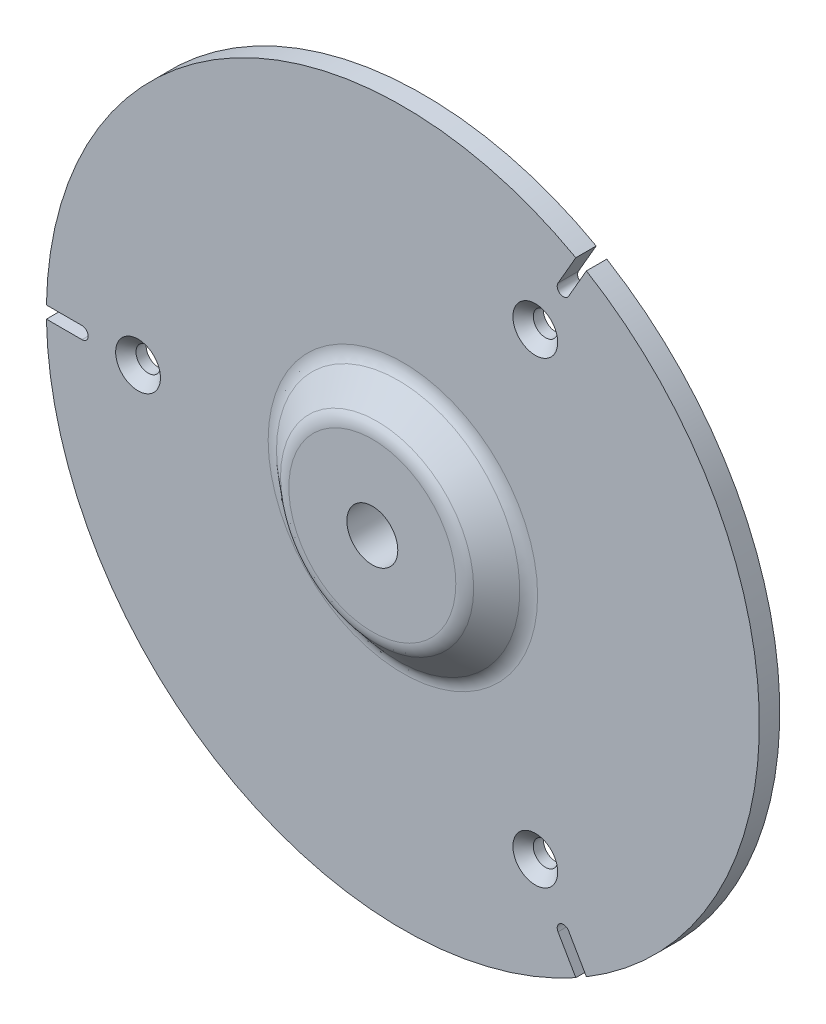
ISO-10303-21;
HEADER;
FILE_DESCRIPTION(('STEP AP214'),'2;1');
FILE_NAME('part.step','',(''),(''),'','','');
FILE_SCHEMA(('AUTOMOTIVE_DESIGN { 1 0 10303 214 1 1 1 1 }'));
ENDSEC;
DATA;
#1=APPLICATION_CONTEXT('core data for automotive mechanical design processes');
#2=APPLICATION_PROTOCOL_DEFINITION('international standard','automotive_design',2000,#1);
#3=PRODUCT_CONTEXT('',#1,'mechanical');
#4=PRODUCT('Part','Part','',(#3));
#5=PRODUCT_RELATED_PRODUCT_CATEGORY('part','',(#4));
#6=PRODUCT_DEFINITION_FORMATION('','',#4);
#7=PRODUCT_DEFINITION_CONTEXT('part definition',#1,'design');
#8=PRODUCT_DEFINITION('design','',#6,#7);
#9=PRODUCT_DEFINITION_SHAPE('','',#8);
#10=(LENGTH_UNIT() NAMED_UNIT(*) SI_UNIT(.MILLI.,.METRE.));
#11=(NAMED_UNIT(*) PLANE_ANGLE_UNIT() SI_UNIT($,.RADIAN.));
#12=(NAMED_UNIT(*) SI_UNIT($,.STERADIAN.) SOLID_ANGLE_UNIT());
#13=UNCERTAINTY_MEASURE_WITH_UNIT(LENGTH_MEASURE(1.E-05),#10,'distance_accuracy_value','');
#14=(GEOMETRIC_REPRESENTATION_CONTEXT(3) GLOBAL_UNCERTAINTY_ASSIGNED_CONTEXT((#13)) GLOBAL_UNIT_ASSIGNED_CONTEXT((#10,
#11,#12)) REPRESENTATION_CONTEXT('',''));
#15=CARTESIAN_POINT('',(0.,0.,0.));
#16=DIRECTION('',(0.,0.,1.));
#17=DIRECTION('',(1.,0.,0.));
#18=AXIS2_PLACEMENT_3D('',#15,#16,#17);
#19=CARTESIAN_POINT('',(0.,0.,2.));
#20=DIRECTION('',(0.,0.,-1.));
#21=DIRECTION('',(-1.,0.,0.));
#22=AXIS2_PLACEMENT_3D('',#19,#20,#21);
#23=PLANE('',#22);
#24=CARTESIAN_POINT('',(13.0000000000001,-22.5166604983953,2.));
#25=DIRECTION('',(0.,0.,1.));
#26=DIRECTION('',(1.,0.,0.));
#27=AXIS2_PLACEMENT_3D('',#24,#25,#26);
#28=CIRCLE('',#27,2.2);
#29=CARTESIAN_POINT('',(15.2000000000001,-22.5166604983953,2.));
#30=VERTEX_POINT('',#29);
#31=EDGE_CURVE('E246',#30,#30,#28,.T.);
#32=ORIENTED_EDGE('',*,*,#31,.F.);
#33=EDGE_LOOP('',(#32));
#34=FACE_BOUND('',#33,.T.);
#35=CARTESIAN_POINT('',(-26.,0.,2.));
#36=DIRECTION('',(0.,0.,1.));
#37=DIRECTION('',(1.,0.,0.));
#38=AXIS2_PLACEMENT_3D('',#35,#36,#37);
#39=CIRCLE('',#38,2.2);
#40=CARTESIAN_POINT('',(-23.8,0.,2.));
#41=VERTEX_POINT('',#40);
#42=EDGE_CURVE('E200',#41,#41,#39,.T.);
#43=ORIENTED_EDGE('',*,*,#42,.F.);
#44=EDGE_LOOP('',(#43));
#45=FACE_BOUND('',#44,.T.);
#46=CARTESIAN_POINT('',(0.,0.,2.));
#47=DIRECTION('',(0.,0.,-1.));
#48=DIRECTION('',(-1.,0.,0.));
#49=AXIS2_PLACEMENT_3D('',#46,#47,#48);
#50=CIRCLE('',#49,13.2279404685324);
#51=CARTESIAN_POINT('',(-13.2279404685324,0.,2.));
#52=VERTEX_POINT('',#51);
#53=EDGE_CURVE('E11',#52,#52,#50,.T.);
#54=ORIENTED_EDGE('',*,*,#53,.T.);
#55=EDGE_LOOP('',(#54));
#56=FACE_BOUND('',#55,.T.);
#57=CARTESIAN_POINT('',(0.,0.,2.));
#58=DIRECTION('',(0.,0.,-1.));
#59=DIRECTION('',(-1.,0.,0.));
#60=AXIS2_PLACEMENT_3D('',#57,#58,#59);
#61=CIRCLE('',#60,35.);
#62=CARTESIAN_POINT('',(18.0170436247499,30.0064349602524,2.));
#63=VERTEX_POINT('',#62);
#64=CARTESIAN_POINT('',(18.0170436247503,-30.0064349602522,2.));
#65=VERTEX_POINT('',#64);
#66=EDGE_CURVE('E148',#63,#65,#61,.T.);
#67=ORIENTED_EDGE('',*,*,#66,.F.);
#68=DIRECTION('',(0.499999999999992,0.866025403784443,0.));
#69=VECTOR('',#68,1.);
#70=CARTESIAN_POINT('',(18.0170436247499,30.0064349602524,2.));
#71=LINE('',#70,#69);
#72=CARTESIAN_POINT('',(16.2696152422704,26.97980021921,2.));
#73=VERTEX_POINT('',#72);
#74=EDGE_CURVE('E131',#73,#63,#71,.T.);
#75=ORIENTED_EDGE('',*,*,#74,.F.);
#76=CARTESIAN_POINT('',(15.7499999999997,27.27980021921,2.));
#77=DIRECTION('',(0.,0.,1.));
#78=DIRECTION('',(0.499999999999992,0.866025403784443,0.));
#79=AXIS2_PLACEMENT_3D('',#76,#77,#78);
#80=CIRCLE('',#79,0.600000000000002);
#81=CARTESIAN_POINT('',(15.2303847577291,27.57980021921,2.));
#82=VERTEX_POINT('',#81);
#83=EDGE_CURVE('E141',#82,#73,#80,.T.);
#84=ORIENTED_EDGE('',*,*,#83,.F.);
#85=DIRECTION('',(-0.499999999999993,-0.866025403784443,0.));
#86=VECTOR('',#85,1.);
#87=CARTESIAN_POINT('',(16.9778131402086,30.6064349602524,2.));
#88=LINE('',#87,#86);
#89=CARTESIAN_POINT('',(16.9778131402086,30.6064349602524,2.));
#90=VERTEX_POINT('',#89);
#91=EDGE_CURVE('E125',#90,#82,#88,.T.);
#92=ORIENTED_EDGE('',*,*,#91,.F.);
#93=CARTESIAN_POINT('',(-34.994856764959,0.6,2.));
#94=VERTEX_POINT('',#93);
#95=EDGE_CURVE('E138',#94,#90,#61,.T.);
#96=ORIENTED_EDGE('',*,*,#95,.F.);
#97=DIRECTION('',(-1.,0.,0.));
#98=VECTOR('',#97,1.);
#99=CARTESIAN_POINT('',(-34.994856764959,0.6,2.));
#100=LINE('',#99,#98);
#101=CARTESIAN_POINT('',(-31.5,0.6,2.));
#102=VERTEX_POINT('',#101);
#103=EDGE_CURVE('E182',#102,#94,#100,.T.);
#104=ORIENTED_EDGE('',*,*,#103,.F.);
#105=CARTESIAN_POINT('',(-31.5,0.,2.));
#106=DIRECTION('',(0.,0.,1.));
#107=DIRECTION('',(-1.,0.,0.));
#108=AXIS2_PLACEMENT_3D('',#105,#106,#107);
#109=CIRCLE('',#108,0.600000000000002);
#110=CARTESIAN_POINT('',(-31.5,-0.600000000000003,2.));
#111=VERTEX_POINT('',#110);
#112=EDGE_CURVE('E188',#111,#102,#109,.T.);
#113=ORIENTED_EDGE('',*,*,#112,.F.);
#114=DIRECTION('',(1.,0.,0.));
#115=VECTOR('',#114,1.);
#116=CARTESIAN_POINT('',(-34.994856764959,-0.6,2.));
#117=LINE('',#116,#115);
#118=CARTESIAN_POINT('',(-34.994856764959,-0.6,2.));
#119=VERTEX_POINT('',#118);
#120=EDGE_CURVE('E191',#119,#111,#117,.T.);
#121=ORIENTED_EDGE('',*,*,#120,.F.);
#122=CARTESIAN_POINT('',(16.977813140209,-30.6064349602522,2.));
#123=VERTEX_POINT('',#122);
#124=EDGE_CURVE('E150',#123,#119,#61,.T.);
#125=ORIENTED_EDGE('',*,*,#124,.F.);
#126=DIRECTION('',(0.500000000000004,-0.866025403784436,0.));
#127=VECTOR('',#126,1.);
#128=CARTESIAN_POINT('',(16.977813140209,-30.6064349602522,2.));
#129=LINE('',#128,#127);
#130=CARTESIAN_POINT('',(15.2303847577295,-27.5798002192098,2.));
#131=VERTEX_POINT('',#130);
#132=EDGE_CURVE('E214',#131,#123,#129,.T.);
#133=ORIENTED_EDGE('',*,*,#132,.F.);
#134=CARTESIAN_POINT('',(15.7500000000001,-27.2798002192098,2.));
#135=DIRECTION('',(0.,0.,1.));
#136=DIRECTION('',(0.500000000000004,-0.866025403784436,0.));
#137=AXIS2_PLACEMENT_3D('',#134,#135,#136);
#138=CIRCLE('',#137,0.600000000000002);
#139=CARTESIAN_POINT('',(16.2696152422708,-26.9798002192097,2.));
#140=VERTEX_POINT('',#139);
#141=EDGE_CURVE('E220',#140,#131,#138,.T.);
#142=ORIENTED_EDGE('',*,*,#141,.F.);
#143=DIRECTION('',(-0.500000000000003,0.866025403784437,0.));
#144=VECTOR('',#143,1.);
#145=CARTESIAN_POINT('',(18.0170436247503,-30.0064349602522,2.));
#146=LINE('',#145,#144);
#147=EDGE_CURVE('E223',#65,#140,#146,.T.);
#148=ORIENTED_EDGE('',*,*,#147,.F.);
#149=EDGE_LOOP('',(#67,#75,#84,#92,#96,#104,#113,#121,#125,#133,#142,#148));
#150=FACE_BOUND('',#149,.T.);
#151=CARTESIAN_POINT('',(12.9999999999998,22.5166604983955,2.));
#152=DIRECTION('',(0.,0.,1.));
#153=DIRECTION('',(1.,0.,0.));
#154=AXIS2_PLACEMENT_3D('',#151,#152,#153);
#155=CIRCLE('',#154,2.2);
#156=CARTESIAN_POINT('',(15.1999999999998,22.5166604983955,2.));
#157=VERTEX_POINT('',#156);
#158=EDGE_CURVE('E255',#157,#157,#155,.T.);
#159=ORIENTED_EDGE('',*,*,#158,.F.);
#160=EDGE_LOOP('',(#159));
#161=FACE_BOUND('',#160,.T.);
#162=ADVANCED_FACE('F33',(#34,#45,#56,#150,#161),#23,.F.);
#163=CARTESIAN_POINT('',(0.,0.,100.994949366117));
#164=DIRECTION('',(0.,0.,-1.));
#165=DIRECTION('',(-1.,0.,0.));
#166=AXIS2_PLACEMENT_3D('',#163,#164,#165);
#167=CYLINDRICAL_SURFACE('',#166,35.);
#168=CARTESIAN_POINT('',(0.,0.,0.));
#169=DIRECTION('',(0.,0.,1.));
#170=DIRECTION('',(1.,0.,0.));
#171=AXIS2_PLACEMENT_3D('',#168,#169,#170);
#172=CIRCLE('',#171,35.);
#173=CARTESIAN_POINT('',(18.0170436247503,-30.0064349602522,0.));
#174=VERTEX_POINT('',#173);
#175=CARTESIAN_POINT('',(18.0170436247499,30.0064349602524,0.));
#176=VERTEX_POINT('',#175);
#177=EDGE_CURVE('E164',#174,#176,#172,.T.);
#178=ORIENTED_EDGE('',*,*,#177,.T.);
#179=DIRECTION('',(0.,0.,1.));
#180=VECTOR('',#179,1.);
#181=CARTESIAN_POINT('',(18.0170436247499,30.0064349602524,-0.00100000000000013));
#182=LINE('',#181,#180);
#183=EDGE_CURVE('E232',#176,#63,#182,.T.);
#184=ORIENTED_EDGE('',*,*,#183,.T.);
#185=ORIENTED_EDGE('',*,*,#66,.T.);
#186=DIRECTION('',(0.,0.,1.));
#187=VECTOR('',#186,1.);
#188=CARTESIAN_POINT('',(18.0170436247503,-30.0064349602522,-0.00100000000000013));
#189=LINE('',#188,#187);
#190=EDGE_CURVE('E211',#174,#65,#189,.T.);
#191=ORIENTED_EDGE('',*,*,#190,.F.);
#192=EDGE_LOOP('',(#178,#184,#185,#191));
#193=FACE_BOUND('',#192,.T.);
#194=ADVANCED_FACE('F281',(#193),#167,.T.);
#195=CARTESIAN_POINT('',(-34.9948567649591,-0.6,0.));
#196=VERTEX_POINT('',#195);
#197=CARTESIAN_POINT('',(16.977813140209,-30.6064349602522,0.));
#198=VERTEX_POINT('',#197);
#199=EDGE_CURVE('E157',#196,#198,#172,.T.);
#200=ORIENTED_EDGE('',*,*,#199,.T.);
#201=DIRECTION('',(0.,0.,1.));
#202=VECTOR('',#201,1.);
#203=CARTESIAN_POINT('',(16.977813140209,-30.6064349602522,-0.00100000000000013));
#204=LINE('',#203,#202);
#205=EDGE_CURVE('E210',#198,#123,#204,.T.);
#206=ORIENTED_EDGE('',*,*,#205,.T.);
#207=ORIENTED_EDGE('',*,*,#124,.T.);
#208=DIRECTION('',(0.,0.,1.));
#209=VECTOR('',#208,1.);
#210=CARTESIAN_POINT('',(-34.994856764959,-0.6,-0.00100000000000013));
#211=LINE('',#210,#209);
#212=EDGE_CURVE('E179',#196,#119,#211,.T.);
#213=ORIENTED_EDGE('',*,*,#212,.F.);
#214=EDGE_LOOP('',(#200,#206,#207,#213));
#215=FACE_BOUND('',#214,.T.);
#216=ADVANCED_FACE('F287',(#215),#167,.T.);
#217=CARTESIAN_POINT('',(0.,0.,0.));
#218=DIRECTION('',(0.,0.,1.));
#219=DIRECTION('',(1.,0.,0.));
#220=AXIS2_PLACEMENT_3D('',#217,#218,#219);
#221=PLANE('',#220);
#222=CARTESIAN_POINT('',(12.9999999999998,22.5166604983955,0.));
#223=DIRECTION('',(0.,0.,1.));
#224=DIRECTION('',(1.,0.,0.));
#225=AXIS2_PLACEMENT_3D('',#222,#223,#224);
#226=CIRCLE('',#225,1.2);
#227=CARTESIAN_POINT('',(14.1999999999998,22.5166604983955,0.));
#228=VERTEX_POINT('',#227);
#229=EDGE_CURVE('E261',#228,#228,#226,.T.);
#230=ORIENTED_EDGE('',*,*,#229,.T.);
#231=EDGE_LOOP('',(#230));
#232=FACE_BOUND('',#231,.T.);
#233=CARTESIAN_POINT('',(13.0000000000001,-22.5166604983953,0.));
#234=DIRECTION('',(0.,0.,1.));
#235=DIRECTION('',(1.,0.,0.));
#236=AXIS2_PLACEMENT_3D('',#233,#234,#235);
#237=CIRCLE('',#236,1.2);
#238=CARTESIAN_POINT('',(14.2000000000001,-22.5166604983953,0.));
#239=VERTEX_POINT('',#238);
#240=EDGE_CURVE('E252',#239,#239,#237,.T.);
#241=ORIENTED_EDGE('',*,*,#240,.T.);
#242=EDGE_LOOP('',(#241));
#243=FACE_BOUND('',#242,.T.);
#244=CARTESIAN_POINT('',(-26.,0.,0.));
#245=DIRECTION('',(0.,0.,1.));
#246=DIRECTION('',(1.,0.,0.));
#247=AXIS2_PLACEMENT_3D('',#244,#245,#246);
#248=CIRCLE('',#247,1.2);
#249=CARTESIAN_POINT('',(-24.8,0.,0.));
#250=VERTEX_POINT('',#249);
#251=EDGE_CURVE('E206',#250,#250,#248,.T.);
#252=ORIENTED_EDGE('',*,*,#251,.T.);
#253=EDGE_LOOP('',(#252));
#254=FACE_BOUND('',#253,.T.);
#255=CARTESIAN_POINT('',(0.,0.,0.));
#256=DIRECTION('',(0.,0.,1.));
#257=DIRECTION('',(1.,0.,0.));
#258=AXIS2_PLACEMENT_3D('',#255,#256,#257);
#259=CIRCLE('',#258,2.5);
#260=CARTESIAN_POINT('',(2.5,0.,0.));
#261=VERTEX_POINT('',#260);
#262=EDGE_CURVE('E169',#261,#261,#259,.T.);
#263=ORIENTED_EDGE('',*,*,#262,.T.);
#264=EDGE_LOOP('',(#263));
#265=FACE_BOUND('',#264,.T.);
#266=CARTESIAN_POINT('',(15.7499999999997,27.27980021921,0.));
#267=DIRECTION('',(0.,0.,1.));
#268=DIRECTION('',(1.,0.,0.));
#269=AXIS2_PLACEMENT_3D('',#266,#267,#268);
#270=CIRCLE('',#269,0.600000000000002);
#271=CARTESIAN_POINT('',(16.2696152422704,26.97980021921,0.));
#272=VERTEX_POINT('',#271);
#273=CARTESIAN_POINT('',(15.2303847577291,27.57980021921,0.));
#274=VERTEX_POINT('',#273);
#275=EDGE_CURVE('E243',#272,#274,#270,.F.);
#276=ORIENTED_EDGE('',*,*,#275,.F.);
#277=DIRECTION('',(-0.499999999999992,-0.866025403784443,0.));
#278=VECTOR('',#277,1.);
#279=CARTESIAN_POINT('',(18.0170436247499,30.0064349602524,0.));
#280=LINE('',#279,#278);
#281=EDGE_CURVE('E142',#176,#272,#280,.T.);
#282=ORIENTED_EDGE('',*,*,#281,.F.);
#283=ORIENTED_EDGE('',*,*,#177,.F.);
#284=DIRECTION('',(0.500000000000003,-0.866025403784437,0.));
#285=VECTOR('',#284,1.);
#286=CARTESIAN_POINT('',(18.0170436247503,-30.0064349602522,0.));
#287=LINE('',#286,#285);
#288=CARTESIAN_POINT('',(16.2696152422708,-26.9798002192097,0.));
#289=VERTEX_POINT('',#288);
#290=EDGE_CURVE('E57',#289,#174,#287,.T.);
#291=ORIENTED_EDGE('',*,*,#290,.F.);
#292=CARTESIAN_POINT('',(15.7500000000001,-27.2798002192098,0.));
#293=DIRECTION('',(0.,0.,1.));
#294=DIRECTION('',(1.,0.,0.));
#295=AXIS2_PLACEMENT_3D('',#292,#293,#294);
#296=CIRCLE('',#295,0.600000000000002);
#297=CARTESIAN_POINT('',(15.2303847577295,-27.5798002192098,0.));
#298=VERTEX_POINT('',#297);
#299=EDGE_CURVE('E229',#298,#289,#296,.F.);
#300=ORIENTED_EDGE('',*,*,#299,.F.);
#301=DIRECTION('',(-0.500000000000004,0.866025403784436,0.));
#302=VECTOR('',#301,1.);
#303=CARTESIAN_POINT('',(16.977813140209,-30.6064349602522,0.));
#304=LINE('',#303,#302);
#305=EDGE_CURVE('E226',#198,#298,#304,.T.);
#306=ORIENTED_EDGE('',*,*,#305,.F.);
#307=ORIENTED_EDGE('',*,*,#199,.F.);
#308=DIRECTION('',(-1.,0.,0.));
#309=VECTOR('',#308,1.);
#310=CARTESIAN_POINT('',(-34.994856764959,-0.6,0.));
#311=LINE('',#310,#309);
#312=CARTESIAN_POINT('',(-31.5,-0.600000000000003,0.));
#313=VERTEX_POINT('',#312);
#314=EDGE_CURVE('E175',#313,#196,#311,.T.);
#315=ORIENTED_EDGE('',*,*,#314,.F.);
#316=CARTESIAN_POINT('',(-31.5,0.,0.));
#317=DIRECTION('',(0.,0.,1.));
#318=DIRECTION('',(1.,0.,0.));
#319=AXIS2_PLACEMENT_3D('',#316,#317,#318);
#320=CIRCLE('',#319,0.600000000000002);
#321=CARTESIAN_POINT('',(-31.5,0.6,0.));
#322=VERTEX_POINT('',#321);
#323=EDGE_CURVE('E197',#322,#313,#320,.F.);
#324=ORIENTED_EDGE('',*,*,#323,.F.);
#325=DIRECTION('',(1.,0.,0.));
#326=VECTOR('',#325,1.);
#327=CARTESIAN_POINT('',(-34.994856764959,0.6,0.));
#328=LINE('',#327,#326);
#329=CARTESIAN_POINT('',(-34.994856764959,0.6,0.));
#330=VERTEX_POINT('',#329);
#331=EDGE_CURVE('E194',#330,#322,#328,.T.);
#332=ORIENTED_EDGE('',*,*,#331,.F.);
#333=CARTESIAN_POINT('',(16.9778131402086,30.6064349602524,0.));
#334=VERTEX_POINT('',#333);
#335=EDGE_CURVE('E165',#334,#330,#172,.T.);
#336=ORIENTED_EDGE('',*,*,#335,.F.);
#337=DIRECTION('',(0.499999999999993,0.866025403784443,0.));
#338=VECTOR('',#337,1.);
#339=CARTESIAN_POINT('',(16.9778131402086,30.6064349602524,0.));
#340=LINE('',#339,#338);
#341=EDGE_CURVE('E49',#274,#334,#340,.T.);
#342=ORIENTED_EDGE('',*,*,#341,.F.);
#343=EDGE_LOOP('',(#276,#282,#283,#291,#300,#306,#307,#315,#324,#332,#336,#342));
#344=FACE_BOUND('',#343,.T.);
#345=ADVANCED_FACE('F265',(#232,#243,#254,#265,#344),#221,.F.);
#346=ORIENTED_EDGE('',*,*,#95,.T.);
#347=DIRECTION('',(0.,0.,1.));
#348=VECTOR('',#347,1.);
#349=CARTESIAN_POINT('',(16.9778131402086,30.6064349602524,-0.00100000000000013));
#350=LINE('',#349,#348);
#351=EDGE_CURVE('E122',#334,#90,#350,.T.);
#352=ORIENTED_EDGE('',*,*,#351,.F.);
#353=ORIENTED_EDGE('',*,*,#335,.T.);
#354=DIRECTION('',(0.,0.,1.));
#355=VECTOR('',#354,1.);
#356=CARTESIAN_POINT('',(-34.994856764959,0.6,-0.00100000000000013));
#357=LINE('',#356,#355);
#358=EDGE_CURVE('E146',#330,#94,#357,.T.);
#359=ORIENTED_EDGE('',*,*,#358,.T.);
#360=EDGE_LOOP('',(#346,#352,#353,#359));
#361=FACE_BOUND('',#360,.T.);
#362=ADVANCED_FACE('F35',(#361),#167,.T.);
#363=CARTESIAN_POINT('',(0.,0.,2.));
#364=DIRECTION('',(0.,0.,-1.));
#365=DIRECTION('',(1.,0.,0.));
#366=AXIS2_PLACEMENT_3D('',#363,#364,#365);
#367=CONICAL_SURFACE('',#366,12.5,0.872664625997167);
#368=CARTESIAN_POINT('',(0.,0.,4.53208888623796));
#369=DIRECTION('',(0.,0.,-1.));
#370=DIRECTION('',(-1.,0.,0.));
#371=AXIS2_PLACEMENT_3D('',#368,#369,#370);
#372=CIRCLE('',#371,9.48237397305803);
#373=CARTESIAN_POINT('',(-9.48237397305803,0.,4.53208888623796));
#374=VERTEX_POINT('',#373);
#375=EDGE_CURVE('E42',#374,#374,#372,.T.);
#376=ORIENTED_EDGE('',*,*,#375,.T.);
#377=EDGE_LOOP('',(#376));
#378=FACE_BOUND('',#377,.T.);
#379=CARTESIAN_POINT('',(0.,0.,2.46791111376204));
#380=DIRECTION('',(0.,0.,-1.));
#381=DIRECTION('',(-1.,0.,0.));
#382=AXIS2_PLACEMENT_3D('',#379,#380,#381);
#383=CIRCLE('',#382,11.9423652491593);
#384=CARTESIAN_POINT('',(-11.9423652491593,0.,2.46791111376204));
#385=VERTEX_POINT('',#384);
#386=EDGE_CURVE('E153',#385,#385,#383,.F.);
#387=ORIENTED_EDGE('',*,*,#386,.T.);
#388=EDGE_LOOP('',(#387));
#389=FACE_BOUND('',#388,.T.);
#390=ADVANCED_FACE('F292',(#378,#389),#367,.T.);
#391=CARTESIAN_POINT('',(0.,0.,5.));
#392=DIRECTION('',(0.,0.,1.));
#393=DIRECTION('',(1.,0.,0.));
#394=AXIS2_PLACEMENT_3D('',#391,#392,#393);
#395=PLANE('',#394);
#396=CARTESIAN_POINT('',(0.,0.,5.));
#397=DIRECTION('',(0.,0.,1.));
#398=DIRECTION('',(1.,0.,0.));
#399=AXIS2_PLACEMENT_3D('',#396,#397,#398);
#400=CIRCLE('',#399,2.49999999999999);
#401=CARTESIAN_POINT('',(2.49999999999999,0.,5.));
#402=VERTEX_POINT('',#401);
#403=EDGE_CURVE('E171',#402,#402,#400,.T.);
#404=ORIENTED_EDGE('',*,*,#403,.F.);
#405=EDGE_LOOP('',(#404));
#406=FACE_BOUND('',#405,.T.);
#407=CARTESIAN_POINT('',(0.,0.,5.));
#408=DIRECTION('',(0.,0.,1.));
#409=DIRECTION('',(1.,0.,0.));
#410=AXIS2_PLACEMENT_3D('',#407,#408,#409);
#411=CIRCLE('',#410,8.19679875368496);
#412=CARTESIAN_POINT('',(8.19679875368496,0.,5.));
#413=VERTEX_POINT('',#412);
#414=EDGE_CURVE('E147',#413,#413,#411,.T.);
#415=ORIENTED_EDGE('',*,*,#414,.T.);
#416=EDGE_LOOP('',(#415));
#417=FACE_BOUND('',#416,.T.);
#418=ADVANCED_FACE('F389',(#406,#417),#395,.T.);
#419=CARTESIAN_POINT('',(0.,0.,3.));
#420=DIRECTION('',(0.,0.,1.));
#421=DIRECTION('',(1.,0.,0.));
#422=AXIS2_PLACEMENT_3D('',#419,#420,#421);
#423=TOROIDAL_SURFACE('',#422,8.19679875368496,2.);
#424=ORIENTED_EDGE('',*,*,#375,.F.);
#425=EDGE_LOOP('',(#424));
#426=FACE_BOUND('',#425,.T.);
#427=ORIENTED_EDGE('',*,*,#414,.F.);
#428=EDGE_LOOP('',(#427));
#429=FACE_BOUND('',#428,.T.);
#430=ADVANCED_FACE('F394',(#426,#429),#423,.T.);
#431=CARTESIAN_POINT('',(0.,0.,4.));
#432=DIRECTION('',(0.,0.,-1.));
#433=DIRECTION('',(-1.,0.,0.));
#434=AXIS2_PLACEMENT_3D('',#431,#432,#433);
#435=TOROIDAL_SURFACE('',#434,13.2279404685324,2.);
#436=ORIENTED_EDGE('',*,*,#53,.F.);
#437=EDGE_LOOP('',(#436));
#438=FACE_BOUND('',#437,.T.);
#439=ORIENTED_EDGE('',*,*,#386,.F.);
#440=EDGE_LOOP('',(#439));
#441=FACE_BOUND('',#440,.T.);
#442=ADVANCED_FACE('F381',(#438,#441),#435,.F.);
#443=CARTESIAN_POINT('',(0.,0.,5.));
#444=DIRECTION('',(0.,0.,1.));
#445=DIRECTION('',(1.,0.,0.));
#446=AXIS2_PLACEMENT_3D('',#443,#444,#445);
#447=CYLINDRICAL_SURFACE('',#446,2.49999999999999);
#448=ORIENTED_EDGE('',*,*,#262,.F.);
#449=EDGE_LOOP('',(#448));
#450=FACE_BOUND('',#449,.T.);
#451=ORIENTED_EDGE('',*,*,#403,.T.);
#452=EDGE_LOOP('',(#451));
#453=FACE_BOUND('',#452,.T.);
#454=ADVANCED_FACE('F370',(#450,#453),#447,.F.);
#455=CARTESIAN_POINT('',(-34.994856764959,0.6,-0.00100000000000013));
#456=DIRECTION('',(0.,1.,0.));
#457=DIRECTION('',(-1.,0.,0.));
#458=AXIS2_PLACEMENT_3D('',#455,#456,#457);
#459=PLANE('',#458);
#460=ORIENTED_EDGE('',*,*,#331,.T.);
#461=DIRECTION('',(0.,0.,1.));
#462=VECTOR('',#461,1.);
#463=CARTESIAN_POINT('',(-31.5,0.6,-0.00100000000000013));
#464=LINE('',#463,#462);
#465=EDGE_CURVE('E184',#322,#102,#464,.T.);
#466=ORIENTED_EDGE('',*,*,#465,.T.);
#467=ORIENTED_EDGE('',*,*,#103,.T.);
#468=ORIENTED_EDGE('',*,*,#358,.F.);
#469=EDGE_LOOP('',(#460,#466,#467,#468));
#470=FACE_BOUND('',#469,.T.);
#471=ADVANCED_FACE('F360',(#470),#459,.F.);
#472=CARTESIAN_POINT('',(-31.5,0.,-0.00100000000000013));
#473=DIRECTION('',(0.,0.,1.));
#474=DIRECTION('',(1.,0.,0.));
#475=AXIS2_PLACEMENT_3D('',#472,#473,#474);
#476=CYLINDRICAL_SURFACE('',#475,0.600000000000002);
#477=ORIENTED_EDGE('',*,*,#323,.T.);
#478=DIRECTION('',(0.,0.,1.));
#479=VECTOR('',#478,1.);
#480=CARTESIAN_POINT('',(-31.5,-0.600000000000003,-0.00100000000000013));
#481=LINE('',#480,#479);
#482=EDGE_CURVE('E181',#313,#111,#481,.T.);
#483=ORIENTED_EDGE('',*,*,#482,.T.);
#484=ORIENTED_EDGE('',*,*,#112,.T.);
#485=ORIENTED_EDGE('',*,*,#465,.F.);
#486=EDGE_LOOP('',(#477,#483,#484,#485));
#487=FACE_BOUND('',#486,.T.);
#488=ADVANCED_FACE('F350',(#487),#476,.F.);
#489=CARTESIAN_POINT('',(-34.994856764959,-0.6,-0.00100000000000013));
#490=DIRECTION('',(0.,-1.,0.));
#491=DIRECTION('',(1.,0.,0.));
#492=AXIS2_PLACEMENT_3D('',#489,#490,#491);
#493=PLANE('',#492);
#494=ORIENTED_EDGE('',*,*,#314,.T.);
#495=ORIENTED_EDGE('',*,*,#212,.T.);
#496=ORIENTED_EDGE('',*,*,#120,.T.);
#497=ORIENTED_EDGE('',*,*,#482,.F.);
#498=EDGE_LOOP('',(#494,#495,#496,#497));
#499=FACE_BOUND('',#498,.T.);
#500=ADVANCED_FACE('F340',(#499),#493,.F.);
#501=CARTESIAN_POINT('',(-26.,0.,2.));
#502=DIRECTION('',(0.,0.,1.));
#503=DIRECTION('',(1.,0.,0.));
#504=AXIS2_PLACEMENT_3D('',#501,#502,#503);
#505=CONICAL_SURFACE('',#504,2.2,0.785398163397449);
#506=CARTESIAN_POINT('',(-26.,0.,1.));
#507=DIRECTION('',(0.,0.,1.));
#508=DIRECTION('',(1.,0.,0.));
#509=AXIS2_PLACEMENT_3D('',#506,#507,#508);
#510=CIRCLE('',#509,1.2);
#511=CARTESIAN_POINT('',(-24.8,0.,1.));
#512=VERTEX_POINT('',#511);
#513=EDGE_CURVE('E203',#512,#512,#510,.T.);
#514=ORIENTED_EDGE('',*,*,#513,.F.);
#515=EDGE_LOOP('',(#514));
#516=FACE_BOUND('',#515,.T.);
#517=ORIENTED_EDGE('',*,*,#42,.T.);
#518=EDGE_LOOP('',(#517));
#519=FACE_BOUND('',#518,.T.);
#520=ADVANCED_FACE('F329',(#516,#519),#505,.F.);
#521=CARTESIAN_POINT('',(-26.,0.,2.));
#522=DIRECTION('',(0.,0.,1.));
#523=DIRECTION('',(1.,0.,0.));
#524=AXIS2_PLACEMENT_3D('',#521,#522,#523);
#525=CYLINDRICAL_SURFACE('',#524,1.2);
#526=ORIENTED_EDGE('',*,*,#251,.F.);
#527=EDGE_LOOP('',(#526));
#528=FACE_BOUND('',#527,.T.);
#529=ORIENTED_EDGE('',*,*,#513,.T.);
#530=EDGE_LOOP('',(#529));
#531=FACE_BOUND('',#530,.T.);
#532=ADVANCED_FACE('F322',(#528,#531),#525,.F.);
#533=CARTESIAN_POINT('',(16.977813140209,-30.6064349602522,-0.00100000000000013));
#534=DIRECTION('',(-0.866025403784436,-0.500000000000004,0.));
#535=DIRECTION('',(0.500000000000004,-0.866025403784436,0.));
#536=AXIS2_PLACEMENT_3D('',#533,#534,#535);
#537=PLANE('',#536);
#538=ORIENTED_EDGE('',*,*,#305,.T.);
#539=DIRECTION('',(0.,0.,1.));
#540=VECTOR('',#539,1.);
#541=CARTESIAN_POINT('',(15.2303847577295,-27.5798002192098,-0.00100000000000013));
#542=LINE('',#541,#540);
#543=EDGE_CURVE('E216',#298,#131,#542,.T.);
#544=ORIENTED_EDGE('',*,*,#543,.T.);
#545=ORIENTED_EDGE('',*,*,#132,.T.);
#546=ORIENTED_EDGE('',*,*,#205,.F.);
#547=EDGE_LOOP('',(#538,#544,#545,#546));
#548=FACE_BOUND('',#547,.T.);
#549=ADVANCED_FACE('F328',(#548),#537,.F.);
#550=CARTESIAN_POINT('',(15.7500000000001,-27.2798002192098,-0.00100000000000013));
#551=DIRECTION('',(0.,0.,1.));
#552=DIRECTION('',(1.,0.,0.));
#553=AXIS2_PLACEMENT_3D('',#550,#551,#552);
#554=CYLINDRICAL_SURFACE('',#553,0.600000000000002);
#555=ORIENTED_EDGE('',*,*,#299,.T.);
#556=DIRECTION('',(0.,0.,1.));
#557=VECTOR('',#556,1.);
#558=CARTESIAN_POINT('',(16.2696152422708,-26.9798002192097,-0.00100000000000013));
#559=LINE('',#558,#557);
#560=EDGE_CURVE('E213',#289,#140,#559,.T.);
#561=ORIENTED_EDGE('',*,*,#560,.T.);
#562=ORIENTED_EDGE('',*,*,#141,.T.);
#563=ORIENTED_EDGE('',*,*,#543,.F.);
#564=EDGE_LOOP('',(#555,#561,#562,#563));
#565=FACE_BOUND('',#564,.T.);
#566=ADVANCED_FACE('F438',(#565),#554,.F.);
#567=CARTESIAN_POINT('',(18.0170436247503,-30.0064349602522,-0.00100000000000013));
#568=DIRECTION('',(0.866025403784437,0.500000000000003,0.));
#569=DIRECTION('',(-0.500000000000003,0.866025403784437,0.));
#570=AXIS2_PLACEMENT_3D('',#567,#568,#569);
#571=PLANE('',#570);
#572=ORIENTED_EDGE('',*,*,#290,.T.);
#573=ORIENTED_EDGE('',*,*,#190,.T.);
#574=ORIENTED_EDGE('',*,*,#147,.T.);
#575=ORIENTED_EDGE('',*,*,#560,.F.);
#576=EDGE_LOOP('',(#572,#573,#574,#575));
#577=FACE_BOUND('',#576,.T.);
#578=ADVANCED_FACE('F448',(#577),#571,.F.);
#579=CARTESIAN_POINT('',(18.0170436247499,30.0064349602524,-0.00100000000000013));
#580=DIRECTION('',(0.866025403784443,-0.499999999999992,0.));
#581=DIRECTION('',(0.499999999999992,0.866025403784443,0.));
#582=AXIS2_PLACEMENT_3D('',#579,#580,#581);
#583=PLANE('',#582);
#584=ORIENTED_EDGE('',*,*,#281,.T.);
#585=DIRECTION('',(0.,0.,1.));
#586=VECTOR('',#585,1.);
#587=CARTESIAN_POINT('',(16.2696152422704,26.97980021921,-0.00100000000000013));
#588=LINE('',#587,#586);
#589=EDGE_CURVE('E235',#272,#73,#588,.T.);
#590=ORIENTED_EDGE('',*,*,#589,.T.);
#591=ORIENTED_EDGE('',*,*,#74,.T.);
#592=ORIENTED_EDGE('',*,*,#183,.F.);
#593=EDGE_LOOP('',(#584,#590,#591,#592));
#594=FACE_BOUND('',#593,.T.);
#595=ADVANCED_FACE('F458',(#594),#583,.F.);
#596=CARTESIAN_POINT('',(15.7499999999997,27.27980021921,-0.00100000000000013));
#597=DIRECTION('',(0.,0.,1.));
#598=DIRECTION('',(1.,0.,0.));
#599=AXIS2_PLACEMENT_3D('',#596,#597,#598);
#600=CYLINDRICAL_SURFACE('',#599,0.600000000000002);
#601=ORIENTED_EDGE('',*,*,#275,.T.);
#602=DIRECTION('',(0.,0.,1.));
#603=VECTOR('',#602,1.);
#604=CARTESIAN_POINT('',(15.2303847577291,27.57980021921,-0.00100000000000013));
#605=LINE('',#604,#603);
#606=EDGE_CURVE('E130',#274,#82,#605,.T.);
#607=ORIENTED_EDGE('',*,*,#606,.T.);
#608=ORIENTED_EDGE('',*,*,#83,.T.);
#609=ORIENTED_EDGE('',*,*,#589,.F.);
#610=EDGE_LOOP('',(#601,#607,#608,#609));
#611=FACE_BOUND('',#610,.T.);
#612=ADVANCED_FACE('F467',(#611),#600,.F.);
#613=CARTESIAN_POINT('',(16.9778131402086,30.6064349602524,-0.00100000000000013));
#614=DIRECTION('',(-0.866025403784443,0.499999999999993,0.));
#615=DIRECTION('',(-0.499999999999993,-0.866025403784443,0.));
#616=AXIS2_PLACEMENT_3D('',#613,#614,#615);
#617=PLANE('',#616);
#618=ORIENTED_EDGE('',*,*,#341,.T.);
#619=ORIENTED_EDGE('',*,*,#351,.T.);
#620=ORIENTED_EDGE('',*,*,#91,.T.);
#621=ORIENTED_EDGE('',*,*,#606,.F.);
#622=EDGE_LOOP('',(#618,#619,#620,#621));
#623=FACE_BOUND('',#622,.T.);
#624=ADVANCED_FACE('F124',(#623),#617,.F.);
#625=CARTESIAN_POINT('',(13.0000000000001,-22.5166604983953,2.));
#626=DIRECTION('',(0.,0.,1.));
#627=DIRECTION('',(1.,0.,0.));
#628=AXIS2_PLACEMENT_3D('',#625,#626,#627);
#629=CONICAL_SURFACE('',#628,2.2,0.785398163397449);
#630=CARTESIAN_POINT('',(13.0000000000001,-22.5166604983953,1.));
#631=DIRECTION('',(0.,0.,1.));
#632=DIRECTION('',(1.,0.,0.));
#633=AXIS2_PLACEMENT_3D('',#630,#631,#632);
#634=CIRCLE('',#633,1.2);
#635=CARTESIAN_POINT('',(14.2000000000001,-22.5166604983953,1.));
#636=VERTEX_POINT('',#635);
#637=EDGE_CURVE('E249',#636,#636,#634,.T.);
#638=ORIENTED_EDGE('',*,*,#637,.F.);
#639=EDGE_LOOP('',(#638));
#640=FACE_BOUND('',#639,.T.);
#641=ORIENTED_EDGE('',*,*,#31,.T.);
#642=EDGE_LOOP('',(#641));
#643=FACE_BOUND('',#642,.T.);
#644=ADVANCED_FACE('F485',(#640,#643),#629,.F.);
#645=CARTESIAN_POINT('',(13.0000000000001,-22.5166604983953,2.));
#646=DIRECTION('',(0.,0.,1.));
#647=DIRECTION('',(1.,0.,0.));
#648=AXIS2_PLACEMENT_3D('',#645,#646,#647);
#649=CYLINDRICAL_SURFACE('',#648,1.2);
#650=ORIENTED_EDGE('',*,*,#240,.F.);
#651=EDGE_LOOP('',(#650));
#652=FACE_BOUND('',#651,.T.);
#653=ORIENTED_EDGE('',*,*,#637,.T.);
#654=EDGE_LOOP('',(#653));
#655=FACE_BOUND('',#654,.T.);
#656=ADVANCED_FACE('F277',(#652,#655),#649,.F.);
#657=CARTESIAN_POINT('',(12.9999999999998,22.5166604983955,2.));
#658=DIRECTION('',(0.,0.,1.));
#659=DIRECTION('',(1.,0.,0.));
#660=AXIS2_PLACEMENT_3D('',#657,#658,#659);
#661=CONICAL_SURFACE('',#660,2.2,0.785398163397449);
#662=CARTESIAN_POINT('',(12.9999999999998,22.5166604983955,1.));
#663=DIRECTION('',(0.,0.,1.));
#664=DIRECTION('',(1.,0.,0.));
#665=AXIS2_PLACEMENT_3D('',#662,#663,#664);
#666=CIRCLE('',#665,1.2);
#667=CARTESIAN_POINT('',(14.1999999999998,22.5166604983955,1.));
#668=VERTEX_POINT('',#667);
#669=EDGE_CURVE('E258',#668,#668,#666,.T.);
#670=ORIENTED_EDGE('',*,*,#669,.F.);
#671=EDGE_LOOP('',(#670));
#672=FACE_BOUND('',#671,.T.);
#673=ORIENTED_EDGE('',*,*,#158,.T.);
#674=EDGE_LOOP('',(#673));
#675=FACE_BOUND('',#674,.T.);
#676=ADVANCED_FACE('F271',(#672,#675),#661,.F.);
#677=CARTESIAN_POINT('',(12.9999999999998,22.5166604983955,2.));
#678=DIRECTION('',(0.,0.,1.));
#679=DIRECTION('',(1.,0.,0.));
#680=AXIS2_PLACEMENT_3D('',#677,#678,#679);
#681=CYLINDRICAL_SURFACE('',#680,1.2);
#682=ORIENTED_EDGE('',*,*,#229,.F.);
#683=EDGE_LOOP('',(#682));
#684=FACE_BOUND('',#683,.T.);
#685=ORIENTED_EDGE('',*,*,#669,.T.);
#686=EDGE_LOOP('',(#685));
#687=FACE_BOUND('',#686,.T.);
#688=ADVANCED_FACE('F268',(#684,#687),#681,.F.);
#689=CLOSED_SHELL('',(#162,#194,#216,#345,#362,#390,#418,#430,#442,#454,#471,#488,#500,#520,
#532,#549,#566,#578,#595,#612,#624,#644,#656,#676,#688));
#690=MANIFOLD_SOLID_BREP('B2',#689);
#691=ADVANCED_BREP_SHAPE_REPRESENTATION('',(#18,#690),#14);
#692=SHAPE_DEFINITION_REPRESENTATION(#9,#691);
ENDSEC;
END-ISO-10303-21;
